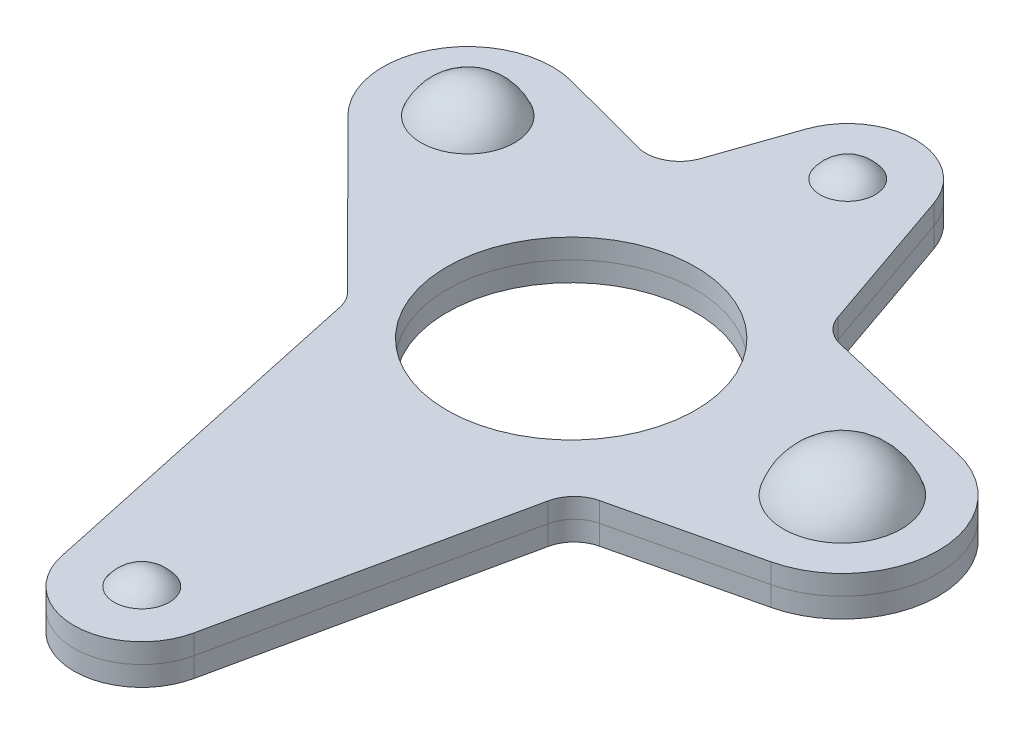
from build123d import *

# Parameters (mm, degrees)
SKIZZEFIDGETSPINNER_R = 11
FIDGETSPINNER_DEPTH   = 1.75


with BuildPart() as part:
    # Grundskizze → Kugel 4 (revolve)
    with BuildSketch(Plane(origin=(0, 0, 0), x_dir=(1, 0, 0), z_dir=(0, 1, 0))):
        with BuildLine():
            Line((0, 27.472202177), (0, 21.472202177))
            ThreePointArc((0, 21.472202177), (3, 24.472202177), (0, 27.472202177))
        make_face()
    revolve(axis=Axis((0, 0, 0), (0, 0, -1)))


with BuildPart() as body_2:
    # Skizze1_8 → Kugel 1 (revolve)
    with BuildSketch(Plane(origin=(0, 0, 0), x_dir=(1, 0, 0), z_dir=(0, 1, 0))):
        with BuildLine():
            Line((29.5, 0), (18.5, 0))
            ThreePointArc((18.5, 0), (24, -5.5), (29.5, 0))
        make_face()
    revolve(axis=Axis((0, 0, 0), (1, 0, 0)))


with BuildPart() as body_3:
    # Skizze1_9 → Kugel 2 (revolve)
    with BuildSketch(Plane(origin=(0, 0, 0), x_dir=(1, 0, 0), z_dir=(0, 1, 0))):
        with BuildLine():
            Line((0, -41), (0, -35))
            ThreePointArc((0, -35), (-3, -38), (0, -41))
        make_face()
    revolve(axis=Axis((0, 0, 0), (0, 0, 1)))


with BuildPart() as body_4:
    # Skizze1_10 → Kugel 3 (revolve)
    with BuildSketch(Plane(origin=(0, 0, 0), x_dir=(1, 0, 0), z_dir=(0, 1, 0))):
        with BuildLine():
            Line((-17.753520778, 10.25), (-25.547749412, 14.75))
            ThreePointArc((-25.547749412, 14.75), (-23.900635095, 8.602885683), (-17.753520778, 10.25))
        make_face()
    revolve(axis=Axis((0, 0, 0), (-0.8660254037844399, 0, -0.4999999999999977)))


with BuildPart() as body_5:
    # SkizzeFidgetSpinner → FidgetSpinner (new, symmetric)
    with BuildSketch(Plane(origin=(0, 0, 0), x_dir=(1, 0, 0), z_dir=(0, 1, 0))):
        with BuildLine():
            Line((5.670350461, 26.433611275), (10.171155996, 13.421973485))
            ThreePointArc((10.171155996, 13.421973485), (10.995688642, 12.176174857), (12.318831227, 11.482516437))
            Line((12.318831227, 11.482516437), (25.947916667, 8.27379119))
            ThreePointArc((25.947916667, 8.27379119), (32.5, 0), (25.947916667, -8.27379119))
            Line((25.947916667, -8.27379119), (13.669035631, -11.164634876))
            ThreePointArc((13.669035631, -11.164634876), (12.215045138, -11.983839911), (11.423771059, -13.453217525))
            Line((11.423771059, -13.453217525), (5.865529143, -39.263157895))
            ThreePointArc((5.865529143, -39.263157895), (0, -44), (-5.865529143, -39.263157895))
            Line((-5.865529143, -39.263157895), (-12.633682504, -7.834940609))
            ThreePointArc((-12.633682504, -7.834940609), (-12.931034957, -7.033130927), (-13.442534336, -6.347794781))
            Line((-13.442534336, -6.347794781), (-26.960416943, 7.203188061))
            ThreePointArc((-26.960416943, 7.203188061), (-28.145825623, 16.25), (-19.718352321, 19.746811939))
            Line((-19.718352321, 19.746811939), (-11.670279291, 17.6008817))
            ThreePointArc((-11.670279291, 17.6008817), (-9.489200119, 17.850631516), (-8.062190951, 19.518901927))
            Line((-8.062190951, 19.518901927), (-5.670350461, 26.433611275))
            ThreePointArc((-5.670350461, 26.433611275), (0, 30.472202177), (5.670350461, 26.433611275))
        make_face()
        with Locations(Location((0, 0, 0), (0, 0, 270))):
            Circle(SKIZZEFIDGETSPINNER_R, mode=Mode.SUBTRACT)
    extrude(amount=FIDGETSPINNER_DEPTH, both=True)

    # Skizze1_13 → LochKugel4 (revolve, cut)
    with BuildSketch(Plane(origin=(0, 0, 0), x_dir=(1, 0, 0), z_dir=(0, 1, 0))):
        with BuildLine():
            Line((0, 27.472202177), (0, 21.472202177))
            ThreePointArc((0, 21.472202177), (3, 24.472202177), (0, 27.472202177))
        make_face()
    revolve(axis=Axis((0, 0, 0), (0, 0, -1)), mode=Mode.SUBTRACT)

    # Skizze1_14 → LochKugel1 (revolve, cut)
    with BuildSketch(Plane(origin=(0, 0, 0), x_dir=(1, 0, 0), z_dir=(0, 1, 0))):
        with BuildLine():
            Line((29.5, 0), (18.5, 0))
            ThreePointArc((18.5, 0), (24, -5.5), (29.5, 0))
        make_face()
    revolve(axis=Axis((0, 0, 0), (1, 0, 0)), mode=Mode.SUBTRACT)

    # Skizze1_15 → LochKugel2 (revolve, cut)
    with BuildSketch(Plane(origin=(0, 0, 0), x_dir=(1, 0, 0), z_dir=(0, 1, 0))):
        with BuildLine():
            Line((0, -41), (0, -35))
            ThreePointArc((0, -35), (-3, -38), (0, -41))
        make_face()
    revolve(axis=Axis((0, 0, 0), (0, 0, 1)), mode=Mode.SUBTRACT)

    # Skizze1_16 → LochKugel3 (revolve, cut)
    with BuildSketch(Plane(origin=(0, 0, 0), x_dir=(1, 0, 0), z_dir=(0, 1, 0))):
        with BuildLine():
            Line((-17.753520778, 10.25), (-25.547749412, 14.75))
            ThreePointArc((-25.547749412, 14.75), (-23.900635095, 8.602885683), (-17.753520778, 10.25))
        make_face()
    revolve(axis=Axis((0, 0, 0), (-0.8660254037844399, 0, -0.4999999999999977)), mode=Mode.SUBTRACT)


with BuildPart() as body_6:
    # Abspalten1: the piece on the far side of the plane
    add(body_5.part)
    split(bisect_by=Plane.ZX, keep=Keep.BOTTOM)


with BuildPart() as body_5_1:
    add(body_5.part)

    # Abspalten1
    split(bisect_by=Plane.ZX, keep=Keep.TOP)


solid = Compound([part.part, body_2.part, body_3.part, body_4.part, body_6.part, body_5_1.part])
